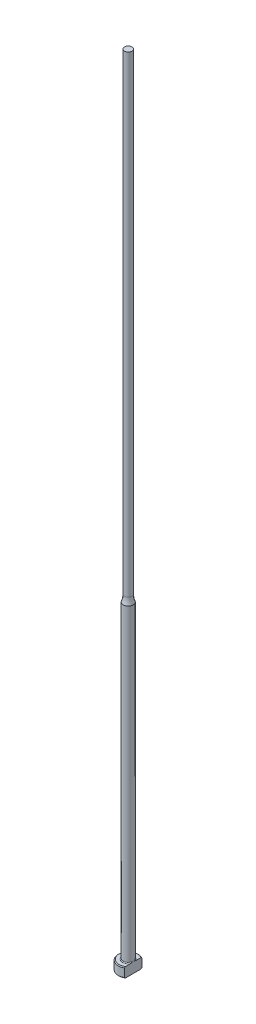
ISO-10303-21;
HEADER;
FILE_DESCRIPTION(('STEP AP214'),'2;1');
FILE_NAME('part.step','',(''),(''),'','','');
FILE_SCHEMA(('AUTOMOTIVE_DESIGN { 1 0 10303 214 1 1 1 1 }'));
ENDSEC;
DATA;
#1=APPLICATION_CONTEXT('core data for automotive mechanical design processes');
#2=APPLICATION_PROTOCOL_DEFINITION('international standard','automotive_design',2000,#1);
#3=PRODUCT_CONTEXT('',#1,'mechanical');
#4=PRODUCT('Part','Part','',(#3));
#5=PRODUCT_RELATED_PRODUCT_CATEGORY('part','',(#4));
#6=PRODUCT_DEFINITION_FORMATION('','',#4);
#7=PRODUCT_DEFINITION_CONTEXT('part definition',#1,'design');
#8=PRODUCT_DEFINITION('design','',#6,#7);
#9=PRODUCT_DEFINITION_SHAPE('','',#8);
#10=(LENGTH_UNIT() NAMED_UNIT(*) SI_UNIT(.MILLI.,.METRE.));
#11=(NAMED_UNIT(*) PLANE_ANGLE_UNIT() SI_UNIT($,.RADIAN.));
#12=(NAMED_UNIT(*) SI_UNIT($,.STERADIAN.) SOLID_ANGLE_UNIT());
#13=UNCERTAINTY_MEASURE_WITH_UNIT(LENGTH_MEASURE(1.E-05),#10,'distance_accuracy_value','');
#14=(GEOMETRIC_REPRESENTATION_CONTEXT(3) GLOBAL_UNCERTAINTY_ASSIGNED_CONTEXT((#13)) GLOBAL_UNIT_ASSIGNED_CONTEXT((#10,
#11,#12)) REPRESENTATION_CONTEXT('',''));
#15=CARTESIAN_POINT('',(0.,0.,0.));
#16=DIRECTION('',(0.,0.,1.));
#17=DIRECTION('',(1.,0.,0.));
#18=AXIS2_PLACEMENT_3D('',#15,#16,#17);
#19=CARTESIAN_POINT('',(-3.17499999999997,3.175,0.));
#20=DIRECTION('',(0.,1.,0.));
#21=DIRECTION('',(0.,0.,1.));
#22=AXIS2_PLACEMENT_3D('',#19,#20,#21);
#23=PLANE('',#22);
#24=CARTESIAN_POINT('',(0.,3.175,0.));
#25=DIRECTION('',(0.,1.,0.));
#26=DIRECTION('',(0.,0.,1.));
#27=AXIS2_PLACEMENT_3D('',#24,#25,#26);
#28=CIRCLE('',#27,2.92099999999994);
#29=CARTESIAN_POINT('',(1.58749999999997,3.175,-2.45195529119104));
#30=VERTEX_POINT('',#29);
#31=CARTESIAN_POINT('',(1.58749999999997,3.175,2.45195529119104));
#32=VERTEX_POINT('',#31);
#33=EDGE_CURVE('E105',#30,#32,#28,.T.);
#34=ORIENTED_EDGE('',*,*,#33,.T.);
#35=DIRECTION('',(0.,0.,1.));
#36=VECTOR('',#35,1.);
#37=CARTESIAN_POINT('',(1.58749999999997,3.17499999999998,2.74963065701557));
#38=LINE('',#37,#36);
#39=CARTESIAN_POINT('',(1.58749999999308,3.175,0.933255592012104));
#40=VERTEX_POINT('',#39);
#41=EDGE_CURVE('E126',#40,#32,#38,.T.);
#42=ORIENTED_EDGE('',*,*,#41,.F.);
#43=CARTESIAN_POINT('',(0.,3.175,0.));
#44=DIRECTION('',(0.,1.,0.));
#45=DIRECTION('',(0.,0.,1.));
#46=AXIS2_PLACEMENT_3D('',#43,#44,#45);
#47=CIRCLE('',#46,1.84149999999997);
#48=CARTESIAN_POINT('',(1.58749999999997,3.17500000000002,-0.933255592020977));
#49=VERTEX_POINT('',#48);
#50=EDGE_CURVE('E11',#40,#49,#47,.F.);
#51=ORIENTED_EDGE('',*,*,#50,.T.);
#52=EDGE_CURVE('E52',#30,#49,#38,.T.);
#53=ORIENTED_EDGE('',*,*,#52,.F.);
#54=EDGE_LOOP('',(#34,#42,#51,#53));
#55=FACE_BOUND('',#54,.T.);
#56=ADVANCED_FACE('F32',(#55),#23,.T.);
#57=CARTESIAN_POINT('',(0.,259.958771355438,0.));
#58=DIRECTION('',(0.,1.,0.));
#59=DIRECTION('',(0.,0.,1.));
#60=AXIS2_PLACEMENT_3D('',#57,#58,#59);
#61=CYLINDRICAL_SURFACE('',#60,3.17499999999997);
#62=CARTESIAN_POINT('',(0.,2.92100000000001,0.));
#63=DIRECTION('',(0.,1.,0.));
#64=DIRECTION('',(0.,0.,1.));
#65=AXIS2_PLACEMENT_3D('',#62,#63,#64);
#66=CIRCLE('',#65,3.17499999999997);
#67=CARTESIAN_POINT('',(1.58749999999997,2.92100000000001,2.74963065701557));
#68=VERTEX_POINT('',#67);
#69=CARTESIAN_POINT('',(1.58749999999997,2.92100000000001,-2.74963065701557));
#70=VERTEX_POINT('',#69);
#71=EDGE_CURVE('E98',#68,#70,#66,.F.);
#72=ORIENTED_EDGE('',*,*,#71,.T.);
#73=DIRECTION('',(0.,-1.,0.));
#74=VECTOR('',#73,1.);
#75=CARTESIAN_POINT('',(1.58749999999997,254.001,-2.74963065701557));
#76=LINE('',#75,#74);
#77=CARTESIAN_POINT('',(1.58749999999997,0.253999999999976,-2.74963065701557));
#78=VERTEX_POINT('',#77);
#79=EDGE_CURVE('E141',#70,#78,#76,.T.);
#80=ORIENTED_EDGE('',*,*,#79,.T.);
#81=CARTESIAN_POINT('',(0.,0.253999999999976,0.));
#82=DIRECTION('',(0.,-1.,0.));
#83=DIRECTION('',(0.,0.,-1.));
#84=AXIS2_PLACEMENT_3D('',#81,#82,#83);
#85=CIRCLE('',#84,3.17499999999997);
#86=CARTESIAN_POINT('',(1.58749999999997,0.253999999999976,2.74963065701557));
#87=VERTEX_POINT('',#86);
#88=EDGE_CURVE('E95',#78,#87,#85,.F.);
#89=ORIENTED_EDGE('',*,*,#88,.T.);
#90=DIRECTION('',(0.,-1.,0.));
#91=VECTOR('',#90,1.);
#92=CARTESIAN_POINT('',(1.58749999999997,254.001,2.74963065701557));
#93=LINE('',#92,#91);
#94=EDGE_CURVE('E88',#68,#87,#93,.T.);
#95=ORIENTED_EDGE('',*,*,#94,.F.);
#96=EDGE_LOOP('',(#72,#80,#89,#95));
#97=FACE_BOUND('',#96,.T.);
#98=ADVANCED_FACE('F191',(#97),#61,.T.);
#99=CARTESIAN_POINT('',(0.,0.,0.));
#100=DIRECTION('',(0.,-1.,0.));
#101=DIRECTION('',(0.,0.,-1.));
#102=AXIS2_PLACEMENT_3D('',#99,#100,#101);
#103=PLANE('',#102);
#104=CARTESIAN_POINT('',(0.,0.,0.));
#105=DIRECTION('',(0.,-1.,0.));
#106=DIRECTION('',(0.,0.,-1.));
#107=AXIS2_PLACEMENT_3D('',#104,#105,#106);
#108=CIRCLE('',#107,2.92100000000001);
#109=CARTESIAN_POINT('',(1.58749999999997,0.,2.45195529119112));
#110=VERTEX_POINT('',#109);
#111=CARTESIAN_POINT('',(1.58749999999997,0.,-2.45195529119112));
#112=VERTEX_POINT('',#111);
#113=EDGE_CURVE('E93',#110,#112,#108,.T.);
#114=ORIENTED_EDGE('',*,*,#113,.T.);
#115=DIRECTION('',(0.,0.,1.));
#116=VECTOR('',#115,1.);
#117=CARTESIAN_POINT('',(1.58749999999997,0.,2.74963065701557));
#118=LINE('',#117,#116);
#119=EDGE_CURVE('E78',#112,#110,#118,.T.);
#120=ORIENTED_EDGE('',*,*,#119,.T.);
#121=EDGE_LOOP('',(#114,#120));
#122=FACE_BOUND('',#121,.T.);
#123=ADVANCED_FACE('F97',(#122),#103,.T.);
#124=CARTESIAN_POINT('',(0.,3.17499999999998,0.));
#125=DIRECTION('',(0.,-1.,0.));
#126=DIRECTION('',(0.,0.,-1.));
#127=AXIS2_PLACEMENT_3D('',#124,#125,#126);
#128=CONICAL_SURFACE('',#127,2.92099999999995,0.785398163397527);
#129=ORIENTED_EDGE('',*,*,#71,.F.);
#130=CARTESIAN_POINT('',(1.58749999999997,-0.16162066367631,-6.0529050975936));
#131=CARTESIAN_POINT('',(1.58749999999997,-0.0288893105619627,-5.91567682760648));
#132=CARTESIAN_POINT('',(1.58749999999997,0.103699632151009,-5.7783103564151));
#133=CARTESIAN_POINT('',(1.58749999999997,0.368508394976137,-5.50321874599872));
#134=CARTESIAN_POINT('',(1.58749999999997,0.500728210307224,-5.36549360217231));
#135=CARTESIAN_POINT('',(1.58749999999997,0.764778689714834,-5.08953516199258));
#136=CARTESIAN_POINT('',(1.58749999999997,0.896609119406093,-4.9513016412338));
#137=CARTESIAN_POINT('',(1.58749999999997,1.15968706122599,-4.67428233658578));
#138=CARTESIAN_POINT('',(1.58749999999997,1.29093457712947,-4.53549655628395));
#139=CARTESIAN_POINT('',(1.58749999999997,1.55007705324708,-4.25997724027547));
#140=CARTESIAN_POINT('',(1.58749999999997,1.67798684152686,-4.12325766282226));
#141=CARTESIAN_POINT('',(1.58749999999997,1.9328486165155,-3.84892898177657));
#142=CARTESIAN_POINT('',(1.58749999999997,2.05980060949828,-3.71131988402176));
#143=CARTESIAN_POINT('',(1.58749999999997,2.31237508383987,-3.43493978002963));
#144=CARTESIAN_POINT('',(1.58749999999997,2.43799784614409,-3.29616903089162));
#145=CARTESIAN_POINT('',(1.58749999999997,2.68741369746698,-3.01699558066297));
#146=CARTESIAN_POINT('',(1.58749999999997,2.81120686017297,-2.8765929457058));
#147=CARTESIAN_POINT('',(1.58749999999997,3.00875865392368,-2.64816703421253));
#148=CARTESIAN_POINT('',(1.58749999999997,3.08336151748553,-2.56087478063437));
#149=CARTESIAN_POINT('',(1.58749999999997,3.2312387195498,-2.38515423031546));
#150=CARTESIAN_POINT('',(1.58749999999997,3.30451292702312,-2.29672582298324));
#151=CARTESIAN_POINT('',(1.58749999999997,3.45004422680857,-2.1174740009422));
#152=CARTESIAN_POINT('',(1.58749999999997,3.5222823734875,-2.02663514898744));
#153=CARTESIAN_POINT('',(1.58749999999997,3.66423097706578,-1.8430252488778));
#154=CARTESIAN_POINT('',(1.58749999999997,3.73394203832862,-1.75025467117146));
#155=CARTESIAN_POINT('',(1.58749999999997,3.87080633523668,-1.5606747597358));
#156=CARTESIAN_POINT('',(1.58749999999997,3.93790459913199,-1.46382547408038));
#157=CARTESIAN_POINT('',(1.58749999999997,4.06669147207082,-1.26632594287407));
#158=CARTESIAN_POINT('',(1.58749999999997,4.1283726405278,-1.16567073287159));
#159=CARTESIAN_POINT('',(1.58749999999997,4.21402252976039,-1.01165766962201));
#160=CARTESIAN_POINT('',(1.58749999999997,4.24127929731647,-0.960142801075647));
#161=CARTESIAN_POINT('',(1.58749999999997,4.2930979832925,-0.855780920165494));
#162=CARTESIAN_POINT('',(1.58749999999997,4.31765941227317,-0.802933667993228));
#163=CARTESIAN_POINT('',(1.58749999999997,4.38614656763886,-0.642461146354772));
#164=CARTESIAN_POINT('',(1.58749999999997,4.42510149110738,-0.532518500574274));
#165=CARTESIAN_POINT('',(1.58749999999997,4.46726244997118,-0.367680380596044));
#166=CARTESIAN_POINT('',(1.58749999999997,4.47844427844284,-0.314802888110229));
#167=CARTESIAN_POINT('',(1.58749999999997,4.49576654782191,-0.208209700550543));
#168=CARTESIAN_POINT('',(1.58749999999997,4.50190743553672,-0.154494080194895));
#169=CARTESIAN_POINT('',(1.58749999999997,4.50871296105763,-0.0468792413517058));
#170=CARTESIAN_POINT('',(1.58749999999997,4.5093945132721,0.00701889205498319));
#171=CARTESIAN_POINT('',(1.58749999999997,4.50527679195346,0.114606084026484));
#172=CARTESIAN_POINT('',(1.58749999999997,4.50047706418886,0.168295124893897));
#173=CARTESIAN_POINT('',(1.58749999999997,4.48579689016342,0.27448544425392));
#174=CARTESIAN_POINT('',(1.58749999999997,4.47596081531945,0.32699298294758));
#175=CARTESIAN_POINT('',(1.58749999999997,4.45181809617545,0.430974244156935));
#176=CARTESIAN_POINT('',(1.58749999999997,4.4375096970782,0.482447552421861));
#177=CARTESIAN_POINT('',(1.58749999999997,4.40502489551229,0.584460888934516));
#178=CARTESIAN_POINT('',(1.58749999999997,4.386827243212,0.634994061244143));
#179=CARTESIAN_POINT('',(1.58749999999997,4.34729308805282,0.734789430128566));
#180=CARTESIAN_POINT('',(1.58749999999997,4.3259572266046,0.784051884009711));
#181=CARTESIAN_POINT('',(1.58749999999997,4.25791922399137,0.930549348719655));
#182=CARTESIAN_POINT('',(1.58749999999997,4.20736047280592,1.0259880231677));
#183=CARTESIAN_POINT('',(1.58749999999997,4.0995545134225,1.21304313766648));
#184=CARTESIAN_POINT('',(1.58749999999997,4.04229912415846,1.30465471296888));
#185=CARTESIAN_POINT('',(1.58749999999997,3.92308746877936,1.48526211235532));
#186=CARTESIAN_POINT('',(1.58749999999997,3.86111349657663,1.57424615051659));
#187=CARTESIAN_POINT('',(1.58749999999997,3.73408621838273,1.74990003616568));
#188=CARTESIAN_POINT('',(1.58749999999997,3.66903444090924,1.83657099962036));
#189=CARTESIAN_POINT('',(1.58749999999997,3.53583371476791,2.00931764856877));
#190=CARTESIAN_POINT('',(1.58749999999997,3.46765527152,2.09537048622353));
#191=CARTESIAN_POINT('',(1.58749999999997,3.32960643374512,2.26611736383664));
#192=CARTESIAN_POINT('',(1.58749999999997,3.25973586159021,2.35081125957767));
#193=CARTESIAN_POINT('',(1.58749999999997,3.04858139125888,2.60290121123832));
#194=CARTESIAN_POINT('',(1.58749999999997,2.90542388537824,2.76872537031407));
#195=CARTESIAN_POINT('',(1.58749999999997,2.64069522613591,3.06970913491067));
#196=CARTESIAN_POINT('',(1.58749999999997,2.51959458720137,3.20528660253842));
#197=CARTESIAN_POINT('',(1.58749999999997,2.27590400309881,3.47510321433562));
#198=CARTESIAN_POINT('',(1.58749999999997,2.15331401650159,3.60934232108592));
#199=CARTESIAN_POINT('',(1.58749999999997,1.90694239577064,3.87695374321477));
#200=CARTESIAN_POINT('',(1.58749999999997,1.78315974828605,4.0103251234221));
#201=CARTESIAN_POINT('',(1.58749999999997,1.53478104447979,4.27630880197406));
#202=CARTESIAN_POINT('',(1.58749999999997,1.41018498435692,4.40892109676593));
#203=CARTESIAN_POINT('',(1.58749999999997,1.0457468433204,4.79499418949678));
#204=CARTESIAN_POINT('',(1.58749999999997,0.80507680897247,5.04767313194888));
#205=CARTESIAN_POINT('',(1.58749999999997,0.443121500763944,5.42550911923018));
#206=CARTESIAN_POINT('',(1.58749999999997,0.322378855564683,5.55118772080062));
#207=CARTESIAN_POINT('',(1.58749999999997,0.0805914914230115,5.80225207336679));
#208=CARTESIAN_POINT('',(1.58749999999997,-0.040453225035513,5.92763782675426));
#209=CARTESIAN_POINT('',(1.58749999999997,-0.161620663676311,6.0529050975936));
#210=B_SPLINE_CURVE_WITH_KNOTS('',3,(#130,#131,#132,#133,#134,#135,#136,#137,#138,#139,#140,
#141,#142,#143,#144,#145,#146,#147,#148,#149,#150,#151,#152,#153,#154,#155,#156,#157,#158,#159,
#160,#161,#162,#163,#164,#165,#166,#167,#168,#169,#170,#171,#172,#173,#174,#175,#176,#177,#178,
#179,#180,#181,#182,#183,#184,#185,#186,#187,#188,#189,#190,#191,#192,#193,#194,#195,#196,#197,
#198,#199,#200,#201,#202,#203,#204,#205,#206,#207,#208,#209),.UNSPECIFIED.,.F.,.F.,(4,2,2,2,2,2,
2,2,2,2,2,2,2,2,2,2,2,2,2,2,2,2,2,2,2,2,2,2,2,2,2,2,2,2,2,2,2,2,2,4),(0.,0.572750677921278,
1.14550874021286,1.71856057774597,2.29160869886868,2.85328006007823,3.4149477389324,
3.97649423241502,4.53801804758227,4.88249307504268,5.22700189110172,5.5751532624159,
5.92322081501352,6.27657800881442,6.63041319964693,6.80518126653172,6.9799810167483,
7.3282426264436,7.49018491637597,7.65211285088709,7.81353889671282,7.97497832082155,
8.13501929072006,8.29512313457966,8.45612518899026,8.61709438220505,8.94062993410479,
9.2645649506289,9.58978187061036,9.91483894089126,10.2441741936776,10.5735441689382,
11.2306812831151,11.7760337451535,12.3214014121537,12.8672825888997,13.4131663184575,
14.4600164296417,14.9828595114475,15.5056983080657),.UNSPECIFIED.);
#211=EDGE_CURVE('E118',#32,#68,#210,.T.);
#212=ORIENTED_EDGE('',*,*,#211,.F.);
#213=ORIENTED_EDGE('',*,*,#33,.F.);
#214=EDGE_CURVE('E117',#70,#30,#210,.T.);
#215=ORIENTED_EDGE('',*,*,#214,.F.);
#216=EDGE_LOOP('',(#129,#212,#213,#215));
#217=FACE_BOUND('',#216,.T.);
#218=ADVANCED_FACE('F162',(#217),#128,.T.);
#219=CARTESIAN_POINT('',(0.,0.253999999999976,0.));
#220=DIRECTION('',(0.,1.,0.));
#221=DIRECTION('',(0.,0.,1.));
#222=AXIS2_PLACEMENT_3D('',#219,#220,#221);
#223=CONICAL_SURFACE('',#222,3.17499999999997,0.785398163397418);
#224=ORIENTED_EDGE('',*,*,#88,.F.);
#225=CARTESIAN_POINT('',(1.58749999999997,3.33662066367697,6.0529050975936));
#226=CARTESIAN_POINT('',(1.58749999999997,3.20388931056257,5.91567682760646));
#227=CARTESIAN_POINT('',(1.58749999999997,3.07130036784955,5.77831035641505));
#228=CARTESIAN_POINT('',(1.58749999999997,2.80649160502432,5.50321874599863));
#229=CARTESIAN_POINT('',(1.58749999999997,2.67427178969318,5.3654936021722));
#230=CARTESIAN_POINT('',(1.58749999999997,2.41022131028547,5.08953516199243));
#231=CARTESIAN_POINT('',(1.58749999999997,2.27839088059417,4.95130164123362));
#232=CARTESIAN_POINT('',(1.58749999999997,2.01531293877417,4.67428233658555));
#233=CARTESIAN_POINT('',(1.58749999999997,1.88406542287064,4.5354965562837));
#234=CARTESIAN_POINT('',(1.58749999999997,1.62492294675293,4.25997724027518));
#235=CARTESIAN_POINT('',(1.58749999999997,1.49701315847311,4.12325766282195));
#236=CARTESIAN_POINT('',(1.58749999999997,1.24215138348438,3.84892898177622));
#237=CARTESIAN_POINT('',(1.58749999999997,1.11519939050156,3.71131988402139));
#238=CARTESIAN_POINT('',(1.58749999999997,0.862624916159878,3.43493978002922));
#239=CARTESIAN_POINT('',(1.58749999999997,0.737002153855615,3.29616903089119));
#240=CARTESIAN_POINT('',(1.58749999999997,0.487586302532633,3.01699558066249));
#241=CARTESIAN_POINT('',(1.58749999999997,0.363793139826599,2.8765929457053));
#242=CARTESIAN_POINT('',(1.58749999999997,0.166241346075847,2.64816703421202));
#243=CARTESIAN_POINT('',(1.58749999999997,0.0916384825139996,2.56087478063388));
#244=CARTESIAN_POINT('',(1.58749999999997,-0.0562387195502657,2.385154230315));
#245=CARTESIAN_POINT('',(1.58749999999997,-0.129512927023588,2.29672582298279));
#246=CARTESIAN_POINT('',(1.58749999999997,-0.27504422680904,2.11747400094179));
#247=CARTESIAN_POINT('',(1.58749999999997,-0.347282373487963,2.02663514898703));
#248=CARTESIAN_POINT('',(1.58749999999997,-0.489230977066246,1.84302524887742));
#249=CARTESIAN_POINT('',(1.58749999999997,-0.558942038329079,1.7502546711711));
#250=CARTESIAN_POINT('',(1.58749999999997,-0.695806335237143,1.56067475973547));
#251=CARTESIAN_POINT('',(1.58749999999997,-0.762904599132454,1.46382547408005));
#252=CARTESIAN_POINT('',(1.58749999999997,-0.891691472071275,1.26632594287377));
#253=CARTESIAN_POINT('',(1.58749999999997,-0.953372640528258,1.16567073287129));
#254=CARTESIAN_POINT('',(1.58749999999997,-1.03902252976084,1.01165766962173));
#255=CARTESIAN_POINT('',(1.58749999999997,-1.06627929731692,0.960142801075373));
#256=CARTESIAN_POINT('',(1.58749999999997,-1.11809798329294,0.85578092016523));
#257=CARTESIAN_POINT('',(1.58749999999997,-1.14265941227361,0.802933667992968));
#258=CARTESIAN_POINT('',(1.58749999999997,-1.21114656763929,0.642461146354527));
#259=CARTESIAN_POINT('',(1.58749999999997,-1.2501014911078,0.532518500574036));
#260=CARTESIAN_POINT('',(1.58749999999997,-1.29226244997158,0.367680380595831));
#261=CARTESIAN_POINT('',(1.58749999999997,-1.30344427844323,0.314802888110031));
#262=CARTESIAN_POINT('',(1.58749999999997,-1.32076654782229,0.208209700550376));
#263=CARTESIAN_POINT('',(1.58749999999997,-1.3269074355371,0.154494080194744));
#264=CARTESIAN_POINT('',(1.58749999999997,-1.333712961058,0.0468792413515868));
#265=CARTESIAN_POINT('',(1.58749999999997,-1.33439451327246,-0.00701889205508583));
#266=CARTESIAN_POINT('',(1.58749999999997,-1.33027679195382,-0.114606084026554));
#267=CARTESIAN_POINT('',(1.58749999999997,-1.32547706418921,-0.168295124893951));
#268=CARTESIAN_POINT('',(1.58749999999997,-1.31079689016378,-0.274485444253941));
#269=CARTESIAN_POINT('',(1.58749999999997,-1.3009608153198,-0.326992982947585));
#270=CARTESIAN_POINT('',(1.58749999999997,-1.27681809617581,-0.430974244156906));
#271=CARTESIAN_POINT('',(1.58749999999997,-1.26250969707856,-0.482447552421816));
#272=CARTESIAN_POINT('',(1.58749999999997,-1.23002489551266,-0.584460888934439));
#273=CARTESIAN_POINT('',(1.58749999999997,-1.21182724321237,-0.634994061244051));
#274=CARTESIAN_POINT('',(1.58749999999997,-1.1722930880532,-0.734789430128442));
#275=CARTESIAN_POINT('',(1.58749999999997,-1.15095722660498,-0.784051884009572));
#276=CARTESIAN_POINT('',(1.58749999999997,-1.08291922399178,-0.93054934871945));
#277=CARTESIAN_POINT('',(1.58749999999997,-1.03236047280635,-1.02598802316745));
#278=CARTESIAN_POINT('',(1.58749999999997,-0.924554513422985,-1.21304313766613));
#279=CARTESIAN_POINT('',(1.58749999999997,-0.86729912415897,-1.30465471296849));
#280=CARTESIAN_POINT('',(1.58749999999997,-0.748087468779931,-1.48526211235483));
#281=CARTESIAN_POINT('',(1.58749999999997,-0.686113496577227,-1.57424615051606));
#282=CARTESIAN_POINT('',(1.58749999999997,-0.55908621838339,-1.74990003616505));
#283=CARTESIAN_POINT('',(1.58749999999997,-0.494034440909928,-1.83657099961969));
#284=CARTESIAN_POINT('',(1.58749999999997,-0.360833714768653,-2.00931764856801));
#285=CARTESIAN_POINT('',(1.58749999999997,-0.292655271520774,-2.09537048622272));
#286=CARTESIAN_POINT('',(1.58749999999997,-0.154606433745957,-2.26611736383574));
#287=CARTESIAN_POINT('',(1.58749999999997,-0.0847358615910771,-2.35081125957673));
#288=CARTESIAN_POINT('',(1.58749999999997,0.126418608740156,-2.60290121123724));
#289=CARTESIAN_POINT('',(1.58749999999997,0.269576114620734,-2.76872537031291));
#290=CARTESIAN_POINT('',(1.58749999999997,0.534304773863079,-3.06970913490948));
#291=CARTESIAN_POINT('',(1.58749999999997,0.655405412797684,-3.20528660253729));
#292=CARTESIAN_POINT('',(1.58749999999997,0.899095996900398,-3.47510321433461));
#293=CARTESIAN_POINT('',(1.58749999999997,1.02168598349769,-3.60934232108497));
#294=CARTESIAN_POINT('',(1.58749999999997,1.26805760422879,-3.87695374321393));
#295=CARTESIAN_POINT('',(1.58749999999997,1.39184025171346,-4.01032512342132));
#296=CARTESIAN_POINT('',(1.58749999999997,1.64021895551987,-4.2763088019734));
#297=CARTESIAN_POINT('',(1.58749999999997,1.76481501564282,-4.40892109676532));
#298=CARTESIAN_POINT('',(1.58749999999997,2.12925315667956,-4.79499418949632));
#299=CARTESIAN_POINT('',(1.58749999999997,2.36992319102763,-5.04767313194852));
#300=CARTESIAN_POINT('',(1.58749999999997,2.73187849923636,-5.42550911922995));
#301=CARTESIAN_POINT('',(1.58749999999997,2.85262114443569,-5.55118772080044));
#302=CARTESIAN_POINT('',(1.58749999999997,3.09440850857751,-5.8022520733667));
#303=CARTESIAN_POINT('',(1.58749999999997,3.2154532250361,-5.92763782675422));
#304=CARTESIAN_POINT('',(1.58749999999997,3.33662066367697,-6.0529050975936));
#305=B_SPLINE_CURVE_WITH_KNOTS('',3,(#225,#226,#227,#228,#229,#230,#231,#232,#233,#234,#235,
#236,#237,#238,#239,#240,#241,#242,#243,#244,#245,#246,#247,#248,#249,#250,#251,#252,#253,#254,
#255,#256,#257,#258,#259,#260,#261,#262,#263,#264,#265,#266,#267,#268,#269,#270,#271,#272,#273,
#274,#275,#276,#277,#278,#279,#280,#281,#282,#283,#284,#285,#286,#287,#288,#289,#290,#291,#292,
#293,#294,#295,#296,#297,#298,#299,#300,#301,#302,#303,#304),.UNSPECIFIED.,.F.,.F.,(4,2,2,2,2,2,
2,2,2,2,2,2,2,2,2,2,2,2,2,2,2,2,2,2,2,2,2,2,2,2,2,2,2,2,2,2,2,2,2,4),(0.,0.57275067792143,
1.14550874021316,1.71856057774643,2.29160869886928,2.85328006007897,3.41494773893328,
3.97649423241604,4.53801804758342,4.88249307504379,5.2270018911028,5.57515326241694,
5.92322081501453,6.27657800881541,6.63041319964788,6.80518126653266,6.97998101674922,
7.32824262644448,7.49018491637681,7.65211285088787,7.81353889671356,7.97497832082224,
8.1350192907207,8.29512313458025,8.45612518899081,8.61709438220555,8.94062993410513,
9.26456495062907,9.58978187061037,9.91483894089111,10.2441741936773,10.5735441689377,
11.2306812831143,11.776033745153,12.3214014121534,12.8672825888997,13.4131663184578,
14.4600164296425,14.9828595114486,15.505698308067),.UNSPECIFIED.);
#306=EDGE_CURVE('E81',#112,#78,#305,.T.);
#307=ORIENTED_EDGE('',*,*,#306,.F.);
#308=ORIENTED_EDGE('',*,*,#113,.F.);
#309=EDGE_CURVE('E84',#87,#110,#305,.T.);
#310=ORIENTED_EDGE('',*,*,#309,.F.);
#311=EDGE_LOOP('',(#224,#307,#308,#310));
#312=FACE_BOUND('',#311,.T.);
#313=ADVANCED_FACE('F92',(#312),#223,.T.);
#314=CARTESIAN_POINT('',(0.,3.42900000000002,0.));
#315=DIRECTION('',(0.,1.,0.));
#316=DIRECTION('',(0.,0.,1.));
#317=AXIS2_PLACEMENT_3D('',#314,#315,#316);
#318=TOROIDAL_SURFACE('',#317,1.84149999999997,0.254);
#319=CARTESIAN_POINT('',(1.58749999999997,3.42900000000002,0.));
#320=CARTESIAN_POINT('',(1.58749999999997,3.42899942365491,-1.9220514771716E-10));
#321=CARTESIAN_POINT('',(1.58749999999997,3.42899884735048,-1.2261161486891E-07));
#322=CARTESIAN_POINT('',(1.58749999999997,3.42899773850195,-5.09676365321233E-07));
#323=CARTESIAN_POINT('',(1.58749999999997,3.42899720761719,-7.78176328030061E-07));
#324=CARTESIAN_POINT('',(1.58749999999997,3.42899614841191,-1.42307272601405E-06));
#325=CARTESIAN_POINT('',(1.58749999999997,3.42899562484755,-1.80713867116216E-06));
#326=CARTESIAN_POINT('',(1.58749999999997,3.42899463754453,-2.63494846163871E-06));
#327=CARTESIAN_POINT('',(1.58749999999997,3.42899417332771,-3.07814756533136E-06));
#328=CARTESIAN_POINT('',(1.58749999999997,3.42899261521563,-4.66897357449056E-06));
#329=CARTESIAN_POINT('',(1.58749999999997,3.42899159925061,-5.89404908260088E-06));
#330=CARTESIAN_POINT('',(1.58749999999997,3.42898979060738,-8.42427511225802E-06));
#331=CARTESIAN_POINT('',(1.58749999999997,3.42898899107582,-9.7248057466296E-06));
#332=CARTESIAN_POINT('',(1.58749999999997,3.42898598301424,-1.48060601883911E-05));
#333=CARTESIAN_POINT('',(1.58749999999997,3.42898393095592,-1.86838281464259E-05));
#334=CARTESIAN_POINT('',(1.58749999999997,3.42898057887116,-2.63261117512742E-05));
#335=CARTESIAN_POINT('',(1.58749999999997,3.42897922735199,-3.00687417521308E-05));
#336=CARTESIAN_POINT('',(1.58749999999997,3.42897347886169,-4.60276298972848E-05));
#337=CARTESIAN_POINT('',(1.58749999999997,3.42896911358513,-5.8247019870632E-05));
#338=CARTESIAN_POINT('',(1.58749999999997,3.42896211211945,-8.11070097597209E-05));
#339=CARTESIAN_POINT('',(1.58749999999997,3.42895931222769,-9.16953114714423E-05));
#340=CARTESIAN_POINT('',(1.58749999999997,3.42893712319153,-0.000168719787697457));
#341=CARTESIAN_POINT('',(1.58749999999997,3.42890881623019,-0.000232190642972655));
#342=CARTESIAN_POINT('',(1.58749999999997,3.42880276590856,-0.000479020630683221));
#343=CARTESIAN_POINT('',(1.58749999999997,3.42873165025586,-0.00066443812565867));
#344=CARTESIAN_POINT('',(1.58749999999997,3.42845137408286,-0.0013844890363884));
#345=CARTESIAN_POINT('',(1.58749999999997,3.42823526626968,-0.00191701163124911));
#346=CARTESIAN_POINT('',(1.58749999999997,3.42735449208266,-0.00409774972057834));
#347=CARTESIAN_POINT('',(1.58749999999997,3.42669768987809,-0.00574830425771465));
#348=CARTESIAN_POINT('',(1.58749999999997,3.4174405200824,-0.0289985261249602));
#349=CARTESIAN_POINT('',(1.58749999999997,3.40878325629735,-0.0505816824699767));
#350=CARTESIAN_POINT('',(1.58749999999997,3.39189297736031,-0.0929947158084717));
#351=CARTESIAN_POINT('',(1.58749999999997,3.38365605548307,-0.11382315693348));
#352=CARTESIAN_POINT('',(1.58749999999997,3.36635393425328,-0.157956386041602));
#353=CARTESIAN_POINT('',(1.58749999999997,3.35730391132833,-0.181267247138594));
#354=CARTESIAN_POINT('',(1.58749999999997,3.33936775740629,-0.228222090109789));
#355=CARTESIAN_POINT('',(1.58749999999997,3.33048420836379,-0.25186705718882));
#356=CARTESIAN_POINT('',(1.58749999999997,3.30894496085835,-0.310512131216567));
#357=CARTESIAN_POINT('',(1.58749999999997,3.29649449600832,-0.345588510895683));
#358=CARTESIAN_POINT('',(1.58749999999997,3.27296975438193,-0.415278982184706));
#359=CARTESIAN_POINT('',(1.58749999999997,3.26186987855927,-0.449884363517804));
#360=CARTESIAN_POINT('',(1.58749999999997,3.2395832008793,-0.524471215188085));
#361=CARTESIAN_POINT('',(1.58749999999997,3.22860862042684,-0.564517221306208));
#362=CARTESIAN_POINT('',(1.58749999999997,3.20902534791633,-0.645529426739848));
#363=CARTESIAN_POINT('',(1.58749999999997,3.20043582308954,-0.686500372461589));
#364=CARTESIAN_POINT('',(1.58749999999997,3.18611712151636,-0.771546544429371));
#365=CARTESIAN_POINT('',(1.58749999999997,3.18059550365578,-0.815658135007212));
#366=CARTESIAN_POINT('',(1.58749999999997,3.17455396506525,-0.904117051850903));
#367=CARTESIAN_POINT('',(1.58749999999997,3.17401361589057,-0.948462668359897));
#368=CARTESIAN_POINT('',(1.58749999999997,3.17898948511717,-1.02531896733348));
#369=CARTESIAN_POINT('',(1.58749999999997,3.1829739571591,-1.05792141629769));
#370=CARTESIAN_POINT('',(1.58749999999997,3.19569167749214,-1.12184393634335));
#371=CARTESIAN_POINT('',(1.58749999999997,3.20436049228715,-1.1531753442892));
#372=CARTESIAN_POINT('',(1.58749999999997,3.22236152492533,-1.19946468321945));
#373=CARTESIAN_POINT('',(1.58749999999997,3.2295150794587,-1.21526783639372));
#374=CARTESIAN_POINT('',(1.58749999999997,3.24587062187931,-1.24583726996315));
#375=CARTESIAN_POINT('',(1.58749999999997,3.25507530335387,-1.26060215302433));
#376=CARTESIAN_POINT('',(1.58749999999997,3.27378481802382,-1.28575815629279));
#377=CARTESIAN_POINT('',(1.58749999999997,3.28289001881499,-1.29644383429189));
#378=CARTESIAN_POINT('',(1.58749999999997,3.30268460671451,-1.31623154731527));
#379=CARTESIAN_POINT('',(1.58749999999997,3.31337067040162,-1.32533681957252));
#380=CARTESIAN_POINT('',(1.58749999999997,3.33349977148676,-1.33941140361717));
#381=CARTESIAN_POINT('',(1.58749999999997,3.34261446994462,-1.34484814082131));
#382=CARTESIAN_POINT('',(1.58749999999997,3.36161455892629,-1.35416329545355));
#383=CARTESIAN_POINT('',(1.58749999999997,3.37149946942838,-1.35804267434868));
#384=CARTESIAN_POINT('',(1.58749999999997,3.39188678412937,-1.36398436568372));
#385=CARTESIAN_POINT('',(1.58749999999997,3.40239309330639,-1.36603350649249));
#386=CARTESIAN_POINT('',(1.58749999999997,3.42360372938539,-1.3680840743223));
#387=CARTESIAN_POINT('',(1.58749999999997,3.43430795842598,-1.36808648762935));
#388=CARTESIAN_POINT('',(1.58749999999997,3.45433283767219,-1.36616208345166));
#389=CARTESIAN_POINT('',(1.58749999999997,3.46367506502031,-1.36444960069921));
#390=CARTESIAN_POINT('',(1.58749999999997,3.48195519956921,-1.35953338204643));
#391=CARTESIAN_POINT('',(1.58749999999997,3.49089304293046,-1.3563294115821));
#392=CARTESIAN_POINT('',(1.58749999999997,3.50850302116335,-1.34848006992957));
#393=CARTESIAN_POINT('',(1.58749999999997,3.5171531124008,-1.34378578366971));
#394=CARTESIAN_POINT('',(1.58749999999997,3.53371257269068,-1.33324445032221));
#395=CARTESIAN_POINT('',(1.58749999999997,3.54162163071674,-1.32739692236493));
#396=CARTESIAN_POINT('',(1.58749999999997,3.56107121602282,-1.31107304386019));
#397=CARTESIAN_POINT('',(1.58749999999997,3.57202221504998,-1.29989286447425));
#398=CARTESIAN_POINT('',(1.58749999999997,3.59202509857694,-1.27593566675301));
#399=CARTESIAN_POINT('',(1.58749999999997,3.60107086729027,-1.26315370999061));
#400=CARTESIAN_POINT('',(1.58749999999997,3.62186023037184,-1.22930733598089));
#401=CARTESIAN_POINT('',(1.58749999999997,3.63240584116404,-1.20751096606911));
#402=CARTESIAN_POINT('',(1.58749999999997,3.65004643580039,-1.16266144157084));
#403=CARTESIAN_POINT('',(1.58749999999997,3.65714435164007,-1.13960937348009));
#404=CARTESIAN_POINT('',(1.58749999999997,3.67265428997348,-1.07603916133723));
#405=CARTESIAN_POINT('',(1.58749999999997,3.67834921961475,-1.03486686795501));
#406=CARTESIAN_POINT('',(1.58749999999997,3.68382880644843,-0.951558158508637));
#407=CARTESIAN_POINT('',(1.58749999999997,3.68350976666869,-0.909417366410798));
#408=CARTESIAN_POINT('',(1.58749999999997,3.67745397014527,-0.811383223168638));
#409=CARTESIAN_POINT('',(1.58749999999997,3.66993873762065,-0.755610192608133));
#410=CARTESIAN_POINT('',(1.58749999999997,3.64933373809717,-0.644937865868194));
#411=CARTESIAN_POINT('',(1.58749999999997,3.63621897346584,-0.59004364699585));
#412=CARTESIAN_POINT('',(1.58749999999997,3.60740922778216,-0.485757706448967));
#413=CARTESIAN_POINT('',(1.58749999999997,3.59201096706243,-0.436281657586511));
#414=CARTESIAN_POINT('',(1.58749999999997,3.55922497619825,-0.338551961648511));
#415=CARTESIAN_POINT('',(1.58749999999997,3.5418584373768,-0.290291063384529));
#416=CARTESIAN_POINT('',(1.58749999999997,3.51760237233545,-0.225557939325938));
#417=CARTESIAN_POINT('',(1.58749999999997,3.51126413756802,-0.208874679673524));
#418=CARTESIAN_POINT('',(1.58749999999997,3.49830042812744,-0.17512392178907));
#419=CARTESIAN_POINT('',(1.58749999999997,3.49167176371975,-0.158057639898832));
#420=CARTESIAN_POINT('',(1.58749999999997,3.47585523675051,-0.117638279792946));
#421=CARTESIAN_POINT('',(1.58749999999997,3.46662970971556,-0.0943002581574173));
#422=CARTESIAN_POINT('',(1.58749999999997,3.44889695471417,-0.0497824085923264));
#423=CARTESIAN_POINT('',(1.58749999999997,3.44040039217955,-0.028598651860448));
#424=CARTESIAN_POINT('',(1.58749999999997,3.43130364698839,-0.00575168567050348));
#425=CARTESIAN_POINT('',(1.58749999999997,3.43064818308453,-0.00410451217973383));
#426=CARTESIAN_POINT('',(1.58749999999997,3.42976776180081,-0.00192459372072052));
#427=CARTESIAN_POINT('',(1.58749999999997,3.42955062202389,-0.00138952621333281));
#428=CARTESIAN_POINT('',(1.58749999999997,3.42926908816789,-0.000666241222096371));
#429=CARTESIAN_POINT('',(1.58749999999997,3.42919771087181,-0.000480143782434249));
#430=CARTESIAN_POINT('',(1.58749999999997,3.42909131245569,-0.000232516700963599));
#431=CARTESIAN_POINT('',(1.58749999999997,3.42906294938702,-0.000168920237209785));
#432=CARTESIAN_POINT('',(1.58749999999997,3.42904072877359,-9.17527162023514E-05));
#433=CARTESIAN_POINT('',(1.58749999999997,3.42903792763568,-8.11550293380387E-05));
#434=CARTESIAN_POINT('',(1.58749999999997,3.42903091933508,-5.82743948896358E-05));
#435=CARTESIAN_POINT('',(1.58749999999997,3.42902654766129,-4.60440001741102E-05));
#436=CARTESIAN_POINT('',(1.58749999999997,3.42902079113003,-3.00727682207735E-05));
#437=CARTESIAN_POINT('',(1.58749999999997,3.42901943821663,-2.63286807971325E-05));
#438=CARTESIAN_POINT('',(1.58749999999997,3.42901608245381,-1.86836529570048E-05));
#439=CARTESIAN_POINT('',(1.58749999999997,3.4290140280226,-1.48046517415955E-05));
#440=CARTESIAN_POINT('',(1.58749999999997,3.42901101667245,-9.72223943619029E-06));
#441=CARTESIAN_POINT('',(1.58749999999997,3.42901021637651,-8.42159649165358E-06));
#442=CARTESIAN_POINT('',(1.58749999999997,3.42900840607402,-5.89129729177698E-06));
#443=CARTESIAN_POINT('',(1.58749999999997,3.42900738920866,-4.66626867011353E-06));
#444=CARTESIAN_POINT('',(1.58749999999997,3.42900582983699,-3.07568803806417E-06));
#445=CARTESIAN_POINT('',(1.58749999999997,3.42900536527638,-2.63259565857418E-06));
#446=CARTESIAN_POINT('',(1.58749999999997,3.4290043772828,-1.80506085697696E-06));
#447=CARTESIAN_POINT('',(1.58749999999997,3.42900385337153,-1.42116387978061E-06));
#448=CARTESIAN_POINT('',(1.58749999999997,3.42900279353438,-7.76675643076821E-07));
#449=CARTESIAN_POINT('',(1.58749999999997,3.42900226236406,-5.08406487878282E-07));
#450=CARTESIAN_POINT('',(1.58749999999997,3.42900115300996,-1.21901887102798E-07));
#451=CARTESIAN_POINT('',(1.58749999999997,3.42900057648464,1.92251677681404E-10));
#452=CARTESIAN_POINT('',(1.58749999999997,3.42900000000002,0.));
#453=B_SPLINE_CURVE_WITH_KNOTS('',3,(#319,#320,#321,#322,#323,#324,#325,#326,#327,#328,#329,
#330,#331,#332,#333,#334,#335,#336,#337,#338,#339,#340,#341,#342,#343,#344,#345,#346,#347,#348,
#349,#350,#351,#352,#353,#354,#355,#356,#357,#358,#359,#360,#361,#362,#363,#364,#365,#366,#367,
#368,#369,#370,#371,#372,#373,#374,#375,#376,#377,#378,#379,#380,#381,#382,#383,#384,#385,#386,
#387,#388,#389,#390,#391,#392,#393,#394,#395,#396,#397,#398,#399,#400,#401,#402,#403,#404,#405,
#406,#407,#408,#409,#410,#411,#412,#413,#414,#415,#416,#417,#418,#419,#420,#421,#422,#423,#424,
#425,#426,#427,#428,#429,#430,#431,#432,#433,#434,#435,#436,#437,#438,#439,#440,#441,#442,#443,
#444,#445,#446,#447,#448,#449,#450,#451,#452),.UNSPECIFIED.,.T.,.F.,(4,2,2,2,2,2,2,2,2,2,2,2,2,
2,2,2,2,2,2,2,2,2,2,2,2,2,2,2,2,2,2,2,2,2,2,2,2,2,2,2,2,2,2,2,2,2,2,2,2,2,2,2,2,2,2,2,2,2,2,2,2,
2,2,2,2,2,4),(0.,1.72815458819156E-06,3.50429255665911E-06,5.44431004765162E-06,
7.3675525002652E-06,1.2119089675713E-05,1.66953775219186E-05,2.98160400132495E-05,
4.17409564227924E-05,8.0660475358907E-05,0.000113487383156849,0.000321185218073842,
0.000917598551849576,0.00264089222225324,0.00797105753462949,0.0777276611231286,
0.144923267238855,0.219939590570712,0.295714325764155,0.407362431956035,0.516367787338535,
0.640878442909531,0.766362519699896,0.899536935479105,1.03216495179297,1.13045740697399,
1.22743103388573,1.27935899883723,1.33135556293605,1.37333248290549,1.41522237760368,
1.44693946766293,1.47863694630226,1.51056074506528,1.54246916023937,1.57083210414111,
1.59919951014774,1.62861579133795,1.65804436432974,1.70472658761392,1.75155645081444,
1.82378709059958,1.89595619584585,2.01995471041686,2.1460932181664,2.31447224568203,
2.48361094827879,2.6389891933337,2.79283011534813,2.84637031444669,2.9012946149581,
2.97658236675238,3.04504771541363,3.05036697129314,3.05209849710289,3.05269709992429,
3.05290520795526,3.05293806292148,3.05297701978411,3.05298895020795,3.05300207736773,
3.05300665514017,3.0530114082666,3.05301333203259,3.05301527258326,3.05301704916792,
3.05301877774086),.UNSPECIFIED.);
#454=CARTESIAN_POINT('',(1.58749999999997,3.42900000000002,0.));
#455=VERTEX_POINT('',#454);
#456=EDGE_CURVE('E47',#455,#49,#453,.T.);
#457=ORIENTED_EDGE('',*,*,#456,.T.);
#458=ORIENTED_EDGE('',*,*,#50,.F.);
#459=CARTESIAN_POINT('',(1.58749999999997,3.42900000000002,0.));
#460=CARTESIAN_POINT('',(1.58749999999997,3.42900057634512,1.9220512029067E-10));
#461=CARTESIAN_POINT('',(1.58749999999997,3.42900115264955,1.22611614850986E-07));
#462=CARTESIAN_POINT('',(1.58749999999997,3.42900226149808,5.09676365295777E-07));
#463=CARTESIAN_POINT('',(1.58749999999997,3.42900279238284,7.78176328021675E-07));
#464=CARTESIAN_POINT('',(1.58749999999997,3.42900385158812,1.42307272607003E-06));
#465=CARTESIAN_POINT('',(1.58749999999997,3.42900437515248,1.80713867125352E-06));
#466=CARTESIAN_POINT('',(1.58749999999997,3.4290053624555,2.63494846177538E-06));
#467=CARTESIAN_POINT('',(1.58749999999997,3.42900582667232,3.0781475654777E-06));
#468=CARTESIAN_POINT('',(1.58749999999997,3.4290073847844,4.66897357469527E-06));
#469=CARTESIAN_POINT('',(1.58749999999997,3.42900840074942,5.89404908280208E-06));
#470=CARTESIAN_POINT('',(1.58749999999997,3.42901020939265,8.42427511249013E-06));
#471=CARTESIAN_POINT('',(1.58749999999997,3.42901100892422,9.72480574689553E-06));
#472=CARTESIAN_POINT('',(1.58749999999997,3.42901401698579,1.48060601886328E-05));
#473=CARTESIAN_POINT('',(1.58749999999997,3.42901606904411,1.86838281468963E-05));
#474=CARTESIAN_POINT('',(1.58749999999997,3.42901942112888,2.63261117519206E-05));
#475=CARTESIAN_POINT('',(1.58749999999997,3.42902077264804,3.00687417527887E-05));
#476=CARTESIAN_POINT('',(1.58749999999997,3.42902652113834,4.60276298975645E-05));
#477=CARTESIAN_POINT('',(1.58749999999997,3.4290308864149,5.82470198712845E-05));
#478=CARTESIAN_POINT('',(1.58749999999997,3.42903788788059,8.11070097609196E-05));
#479=CARTESIAN_POINT('',(1.58749999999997,3.42904068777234,9.16953114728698E-05));
#480=CARTESIAN_POINT('',(1.58749999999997,3.4290628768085,0.000168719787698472));
#481=CARTESIAN_POINT('',(1.58749999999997,3.42909118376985,0.000232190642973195));
#482=CARTESIAN_POINT('',(1.58749999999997,3.42919723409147,0.000479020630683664));
#483=CARTESIAN_POINT('',(1.58749999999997,3.42926834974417,0.000664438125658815));
#484=CARTESIAN_POINT('',(1.58749999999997,3.42954862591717,0.00138448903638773));
#485=CARTESIAN_POINT('',(1.58749999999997,3.42976473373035,0.00191701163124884));
#486=CARTESIAN_POINT('',(1.58749999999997,3.43064550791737,0.00409774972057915));
#487=CARTESIAN_POINT('',(1.58749999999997,3.43130231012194,0.00574830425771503));
#488=CARTESIAN_POINT('',(1.58749999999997,3.44055947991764,0.0289985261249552));
#489=CARTESIAN_POINT('',(1.58749999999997,3.44921674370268,0.0505816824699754));
#490=CARTESIAN_POINT('',(1.58749999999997,3.46610702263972,0.0929947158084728));
#491=CARTESIAN_POINT('',(1.58749999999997,3.47434394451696,0.11382315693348));
#492=CARTESIAN_POINT('',(1.58749999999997,3.49164606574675,0.157956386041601));
#493=CARTESIAN_POINT('',(1.58749999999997,3.5006960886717,0.181267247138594));
#494=CARTESIAN_POINT('',(1.58749999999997,3.51863224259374,0.228222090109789));
#495=CARTESIAN_POINT('',(1.58749999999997,3.52751579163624,0.25186705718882));
#496=CARTESIAN_POINT('',(1.58749999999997,3.54905503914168,0.310512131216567));
#497=CARTESIAN_POINT('',(1.58749999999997,3.56150550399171,0.345588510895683));
#498=CARTESIAN_POINT('',(1.58749999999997,3.5850302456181,0.415278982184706));
#499=CARTESIAN_POINT('',(1.58749999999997,3.59613012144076,0.449884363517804));
#500=CARTESIAN_POINT('',(1.58749999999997,3.61841679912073,0.524471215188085));
#501=CARTESIAN_POINT('',(1.58749999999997,3.62939137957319,0.564517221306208));
#502=CARTESIAN_POINT('',(1.58749999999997,3.6489746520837,0.645529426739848));
#503=CARTESIAN_POINT('',(1.58749999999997,3.65756417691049,0.686500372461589));
#504=CARTESIAN_POINT('',(1.58749999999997,3.67188287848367,0.771546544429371));
#505=CARTESIAN_POINT('',(1.58749999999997,3.67740449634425,0.815658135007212));
#506=CARTESIAN_POINT('',(1.58749999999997,3.68344603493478,0.904117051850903));
#507=CARTESIAN_POINT('',(1.58749999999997,3.68398638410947,0.948462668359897));
#508=CARTESIAN_POINT('',(1.58749999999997,3.67901051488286,1.02531896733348));
#509=CARTESIAN_POINT('',(1.58749999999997,3.67502604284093,1.05792141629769));
#510=CARTESIAN_POINT('',(1.58749999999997,3.66230832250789,1.12184393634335));
#511=CARTESIAN_POINT('',(1.58749999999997,3.65363950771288,1.1531753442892));
#512=CARTESIAN_POINT('',(1.58749999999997,3.6356384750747,1.19946468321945));
#513=CARTESIAN_POINT('',(1.58749999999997,3.62848492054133,1.21526783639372));
#514=CARTESIAN_POINT('',(1.58749999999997,3.61212937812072,1.24583726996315));
#515=CARTESIAN_POINT('',(1.58749999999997,3.60292469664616,1.26060215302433));
#516=CARTESIAN_POINT('',(1.58749999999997,3.58421518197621,1.28575815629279));
#517=CARTESIAN_POINT('',(1.58749999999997,3.57510998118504,1.29644383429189));
#518=CARTESIAN_POINT('',(1.58749999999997,3.55531539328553,1.31623154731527));
#519=CARTESIAN_POINT('',(1.58749999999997,3.54462932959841,1.32533681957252));
#520=CARTESIAN_POINT('',(1.58749999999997,3.52450022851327,1.33941140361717));
#521=CARTESIAN_POINT('',(1.58749999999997,3.51538553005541,1.34484814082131));
#522=CARTESIAN_POINT('',(1.58749999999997,3.49638544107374,1.35416329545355));
#523=CARTESIAN_POINT('',(1.58749999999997,3.48650053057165,1.35804267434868));
#524=CARTESIAN_POINT('',(1.58749999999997,3.46611321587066,1.36398436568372));
#525=CARTESIAN_POINT('',(1.58749999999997,3.45560690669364,1.36603350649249));
#526=CARTESIAN_POINT('',(1.58749999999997,3.43439627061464,1.3680840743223));
#527=CARTESIAN_POINT('',(1.58749999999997,3.42369204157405,1.36808648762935));
#528=CARTESIAN_POINT('',(1.58749999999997,3.40366716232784,1.36616208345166));
#529=CARTESIAN_POINT('',(1.58749999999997,3.39432493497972,1.36444960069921));
#530=CARTESIAN_POINT('',(1.58749999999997,3.37604480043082,1.35953338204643));
#531=CARTESIAN_POINT('',(1.58749999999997,3.36710695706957,1.3563294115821));
#532=CARTESIAN_POINT('',(1.58749999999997,3.34949697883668,1.34848006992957));
#533=CARTESIAN_POINT('',(1.58749999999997,3.34084688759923,1.34378578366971));
#534=CARTESIAN_POINT('',(1.58749999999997,3.32428742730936,1.33324445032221));
#535=CARTESIAN_POINT('',(1.58749999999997,3.31637836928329,1.32739692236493));
#536=CARTESIAN_POINT('',(1.58749999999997,3.29692878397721,1.31107304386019));
#537=CARTESIAN_POINT('',(1.58749999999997,3.28597778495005,1.29989286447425));
#538=CARTESIAN_POINT('',(1.58749999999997,3.26597490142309,1.27593566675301));
#539=CARTESIAN_POINT('',(1.58749999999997,3.25692913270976,1.26315370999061));
#540=CARTESIAN_POINT('',(1.58749999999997,3.23613976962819,1.22930733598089));
#541=CARTESIAN_POINT('',(1.58749999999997,3.22559415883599,1.20751096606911));
#542=CARTESIAN_POINT('',(1.58749999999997,3.20795356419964,1.16266144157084));
#543=CARTESIAN_POINT('',(1.58749999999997,3.20085564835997,1.13960937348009));
#544=CARTESIAN_POINT('',(1.58749999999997,3.18534571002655,1.07603916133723));
#545=CARTESIAN_POINT('',(1.58749999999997,3.17965078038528,1.03486686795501));
#546=CARTESIAN_POINT('',(1.58749999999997,3.1741711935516,0.951558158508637));
#547=CARTESIAN_POINT('',(1.58749999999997,3.17449023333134,0.909417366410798));
#548=CARTESIAN_POINT('',(1.58749999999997,3.18054602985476,0.811383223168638));
#549=CARTESIAN_POINT('',(1.58749999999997,3.18806126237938,0.755610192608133));
#550=CARTESIAN_POINT('',(1.58749999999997,3.20866626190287,0.644937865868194));
#551=CARTESIAN_POINT('',(1.58749999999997,3.2217810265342,0.59004364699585));
#552=CARTESIAN_POINT('',(1.58749999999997,3.25059077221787,0.485757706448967));
#553=CARTESIAN_POINT('',(1.58749999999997,3.2659890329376,0.43628165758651));
#554=CARTESIAN_POINT('',(1.58749999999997,3.29877502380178,0.338551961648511));
#555=CARTESIAN_POINT('',(1.58749999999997,3.31614156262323,0.290291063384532));
#556=CARTESIAN_POINT('',(1.58749999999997,3.34039762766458,0.225557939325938));
#557=CARTESIAN_POINT('',(1.58749999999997,3.346735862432,0.208874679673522));
#558=CARTESIAN_POINT('',(1.58749999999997,3.35969957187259,0.175123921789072));
#559=CARTESIAN_POINT('',(1.58749999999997,3.3663282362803,0.15805763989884));
#560=CARTESIAN_POINT('',(1.58749999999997,3.3821447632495,0.117638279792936));
#561=CARTESIAN_POINT('',(1.58749999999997,3.39137029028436,0.0943002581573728));
#562=CARTESIAN_POINT('',(1.58749999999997,3.40910304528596,0.0497824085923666));
#563=CARTESIAN_POINT('',(1.58749999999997,3.41759960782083,0.0285986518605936));
#564=CARTESIAN_POINT('',(1.58749999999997,3.42669635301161,0.00575168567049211));
#565=CARTESIAN_POINT('',(1.58749999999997,3.42735181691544,0.00410451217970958));
#566=CARTESIAN_POINT('',(1.58749999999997,3.42823223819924,0.00192459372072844));
#567=CARTESIAN_POINT('',(1.58749999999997,3.42844937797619,0.00138952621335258));
#568=CARTESIAN_POINT('',(1.58749999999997,3.42873091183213,0.000666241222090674));
#569=CARTESIAN_POINT('',(1.58749999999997,3.42880228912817,0.000480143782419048));
#570=CARTESIAN_POINT('',(1.58749999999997,3.42890868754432,0.000232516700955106));
#571=CARTESIAN_POINT('',(1.58749999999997,3.42893705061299,0.000168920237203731));
#572=CARTESIAN_POINT('',(1.58749999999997,3.42895927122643,9.17527161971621E-05));
#573=CARTESIAN_POINT('',(1.58749999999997,3.42896207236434,8.1155029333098E-05));
#574=CARTESIAN_POINT('',(1.58749999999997,3.42896908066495,5.82743948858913E-05));
#575=CARTESIAN_POINT('',(1.58749999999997,3.42897345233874,4.60440001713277E-05));
#576=CARTESIAN_POINT('',(1.58749999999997,3.42897920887,3.00727682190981E-05));
#577=CARTESIAN_POINT('',(1.58749999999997,3.42898056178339,2.63286807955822E-05));
#578=CARTESIAN_POINT('',(1.58749999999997,3.42898391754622,1.86836529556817E-05));
#579=CARTESIAN_POINT('',(1.58749999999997,3.42898597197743,1.48046517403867E-05));
#580=CARTESIAN_POINT('',(1.58749999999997,3.42898898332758,9.72223943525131E-06));
#581=CARTESIAN_POINT('',(1.58749999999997,3.42898978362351,8.42159649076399E-06));
#582=CARTESIAN_POINT('',(1.58749999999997,3.42899159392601,5.89129729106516E-06));
#583=CARTESIAN_POINT('',(1.58749999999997,3.42899261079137,4.66626866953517E-06));
#584=CARTESIAN_POINT('',(1.58749999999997,3.42899417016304,3.0756880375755E-06));
#585=CARTESIAN_POINT('',(1.58749999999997,3.42899463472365,2.63259565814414E-06));
#586=CARTESIAN_POINT('',(1.58749999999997,3.42899562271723,1.80506085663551E-06));
#587=CARTESIAN_POINT('',(1.58749999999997,3.42899614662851,1.42116387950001E-06));
#588=CARTESIAN_POINT('',(1.58749999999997,3.42899720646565,7.7667564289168E-07));
#589=CARTESIAN_POINT('',(1.58749999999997,3.42899773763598,5.0840648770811E-07));
#590=CARTESIAN_POINT('',(1.58749999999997,3.42899884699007,1.21901887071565E-07));
#591=CARTESIAN_POINT('',(1.58749999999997,3.42899942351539,-1.92251650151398E-10));
#592=CARTESIAN_POINT('',(1.58749999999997,3.42900000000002,0.));
#593=B_SPLINE_CURVE_WITH_KNOTS('',3,(#459,#460,#461,#462,#463,#464,#465,#466,#467,#468,#469,
#470,#471,#472,#473,#474,#475,#476,#477,#478,#479,#480,#481,#482,#483,#484,#485,#486,#487,#488,
#489,#490,#491,#492,#493,#494,#495,#496,#497,#498,#499,#500,#501,#502,#503,#504,#505,#506,#507,
#508,#509,#510,#511,#512,#513,#514,#515,#516,#517,#518,#519,#520,#521,#522,#523,#524,#525,#526,
#527,#528,#529,#530,#531,#532,#533,#534,#535,#536,#537,#538,#539,#540,#541,#542,#543,#544,#545,
#546,#547,#548,#549,#550,#551,#552,#553,#554,#555,#556,#557,#558,#559,#560,#561,#562,#563,#564,
#565,#566,#567,#568,#569,#570,#571,#572,#573,#574,#575,#576,#577,#578,#579,#580,#581,#582,#583,
#584,#585,#586,#587,#588,#589,#590,#591,#592),.UNSPECIFIED.,.T.,.F.,(4,2,2,2,2,2,2,2,2,2,2,2,2,
2,2,2,2,2,2,2,2,2,2,2,2,2,2,2,2,2,2,2,2,2,2,2,2,2,2,2,2,2,2,2,2,2,2,2,2,2,2,2,2,2,2,2,2,2,2,2,2,
2,2,2,2,2,4),(0.,1.72815458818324E-06,3.50429255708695E-06,5.44431004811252E-06,
7.36755250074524E-06,1.21190896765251E-05,1.66953775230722E-05,2.98160400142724E-05,
4.17409564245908E-05,8.06604753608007E-05,0.000113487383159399,0.000321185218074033,
0.000917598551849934,0.00264089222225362,0.00797105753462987,0.077727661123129,
0.144923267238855,0.219939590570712,0.295714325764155,0.407362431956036,0.516367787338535,
0.640878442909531,0.766362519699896,0.899536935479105,1.03216495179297,1.13045740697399,
1.22743103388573,1.27935899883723,1.33135556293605,1.37333248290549,1.41522237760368,
1.44693946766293,1.47863694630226,1.51056074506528,1.54246916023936,1.57083210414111,
1.59919951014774,1.62861579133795,1.65804436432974,1.70472658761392,1.75155645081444,
1.82378709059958,1.89595619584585,2.01995471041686,2.1460932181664,2.31447224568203,
2.48361094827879,2.6389891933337,2.79283011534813,2.84637031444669,2.9012946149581,
2.97658236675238,3.04504771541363,3.05036697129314,3.05209849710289,3.05269709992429,
3.05290520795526,3.05293806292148,3.05297701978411,3.05298895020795,3.05300207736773,
3.05300665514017,3.0530114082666,3.05301333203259,3.05301527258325,3.05301704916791,
3.05301877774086),.UNSPECIFIED.);
#594=EDGE_CURVE('E147',#40,#455,#593,.T.);
#595=ORIENTED_EDGE('',*,*,#594,.T.);
#596=CARTESIAN_POINT('',(0.,3.42900000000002,0.));
#597=DIRECTION('',(0.,1.,0.));
#598=DIRECTION('',(0.,0.,1.));
#599=AXIS2_PLACEMENT_3D('',#596,#597,#598);
#600=CIRCLE('',#599,1.58749999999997);
#601=EDGE_CURVE('E40',#455,#455,#600,.T.);
#602=ORIENTED_EDGE('',*,*,#601,.F.);
#603=EDGE_LOOP('',(#457,#458,#595,#602));
#604=FACE_BOUND('',#603,.T.);
#605=ADVANCED_FACE('F34',(#604),#318,.F.);
#606=CARTESIAN_POINT('',(-1.18998999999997,254.,0.));
#607=DIRECTION('',(0.,1.,0.));
#608=DIRECTION('',(0.,0.,1.));
#609=AXIS2_PLACEMENT_3D('',#606,#607,#608);
#610=PLANE('',#609);
#611=CARTESIAN_POINT('',(0.,254.,0.));
#612=DIRECTION('',(0.,1.,0.));
#613=DIRECTION('',(0.,0.,1.));
#614=AXIS2_PLACEMENT_3D('',#611,#612,#613);
#615=CIRCLE('',#614,1.18998999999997);
#616=CARTESIAN_POINT('',(0.,254.,1.18998999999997));
#617=VERTEX_POINT('',#616);
#618=EDGE_CURVE('E108',#617,#617,#615,.T.);
#619=ORIENTED_EDGE('',*,*,#618,.T.);
#620=EDGE_LOOP('',(#619));
#621=FACE_BOUND('',#620,.T.);
#622=ADVANCED_FACE('F180',(#621),#610,.T.);
#623=CARTESIAN_POINT('',(0.,259.958771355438,0.));
#624=DIRECTION('',(0.,1.,0.));
#625=DIRECTION('',(0.,0.,1.));
#626=AXIS2_PLACEMENT_3D('',#623,#624,#625);
#627=CYLINDRICAL_SURFACE('',#626,1.18998999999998);
#628=CARTESIAN_POINT('',(0.,103.811416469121,0.));
#629=DIRECTION('',(0.,1.,0.));
#630=DIRECTION('',(0.,0.,1.));
#631=AXIS2_PLACEMENT_3D('',#628,#629,#630);
#632=CIRCLE('',#631,1.18998999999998);
#633=CARTESIAN_POINT('',(0.,103.811416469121,1.18998999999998));
#634=VERTEX_POINT('',#633);
#635=EDGE_CURVE('E111',#634,#634,#632,.T.);
#636=ORIENTED_EDGE('',*,*,#635,.T.);
#637=EDGE_LOOP('',(#636));
#638=FACE_BOUND('',#637,.T.);
#639=ORIENTED_EDGE('',*,*,#618,.F.);
#640=EDGE_LOOP('',(#639));
#641=FACE_BOUND('',#640,.T.);
#642=ADVANCED_FACE('F174',(#638,#641),#627,.T.);
#643=CARTESIAN_POINT('',(0.,103.811416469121,0.));
#644=DIRECTION('',(0.,1.,0.));
#645=DIRECTION('',(0.,0.,1.));
#646=AXIS2_PLACEMENT_3D('',#643,#644,#645);
#647=TOROIDAL_SURFACE('',#646,7.53998999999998,6.35);
#648=CARTESIAN_POINT('',(0.,101.6,0.));
#649=DIRECTION('',(0.,1.,0.));
#650=DIRECTION('',(0.,0.,1.));
#651=AXIS2_PLACEMENT_3D('',#648,#649,#650);
#652=CIRCLE('',#651,1.58749999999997);
#653=CARTESIAN_POINT('',(0.,101.6,1.58749999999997));
#654=VERTEX_POINT('',#653);
#655=EDGE_CURVE('E114',#654,#654,#652,.T.);
#656=ORIENTED_EDGE('',*,*,#655,.T.);
#657=EDGE_LOOP('',(#656));
#658=FACE_BOUND('',#657,.T.);
#659=ORIENTED_EDGE('',*,*,#635,.F.);
#660=EDGE_LOOP('',(#659));
#661=FACE_BOUND('',#660,.T.);
#662=ADVANCED_FACE('F168',(#658,#661),#647,.F.);
#663=CARTESIAN_POINT('',(0.,259.958771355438,0.));
#664=DIRECTION('',(0.,1.,0.));
#665=DIRECTION('',(0.,0.,1.));
#666=AXIS2_PLACEMENT_3D('',#663,#664,#665);
#667=CYLINDRICAL_SURFACE('',#666,1.58749999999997);
#668=ORIENTED_EDGE('',*,*,#601,.T.);
#669=EDGE_LOOP('',(#668));
#670=FACE_BOUND('',#669,.T.);
#671=ORIENTED_EDGE('',*,*,#655,.F.);
#672=EDGE_LOOP('',(#671));
#673=FACE_BOUND('',#672,.T.);
#674=ADVANCED_FACE('F165',(#670,#673),#667,.T.);
#675=CARTESIAN_POINT('',(1.58749999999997,254.001,2.74963065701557));
#676=DIRECTION('',(1.,0.,0.));
#677=DIRECTION('',(0.,0.,-1.));
#678=AXIS2_PLACEMENT_3D('',#675,#676,#677);
#679=PLANE('',#678);
#680=ORIENTED_EDGE('',*,*,#309,.T.);
#681=ORIENTED_EDGE('',*,*,#119,.F.);
#682=ORIENTED_EDGE('',*,*,#306,.T.);
#683=ORIENTED_EDGE('',*,*,#79,.F.);
#684=ORIENTED_EDGE('',*,*,#214,.T.);
#685=ORIENTED_EDGE('',*,*,#52,.T.);
#686=ORIENTED_EDGE('',*,*,#456,.F.);
#687=ORIENTED_EDGE('',*,*,#594,.F.);
#688=ORIENTED_EDGE('',*,*,#41,.T.);
#689=ORIENTED_EDGE('',*,*,#211,.T.);
#690=ORIENTED_EDGE('',*,*,#94,.T.);
#691=EDGE_LOOP('',(#680,#681,#682,#683,#684,#685,#686,#687,#688,#689,#690));
#692=FACE_BOUND('',#691,.T.);
#693=ADVANCED_FACE('F80',(#692),#679,.T.);
#694=CLOSED_SHELL('',(#56,#98,#123,#218,#313,#605,#622,#642,#662,#674,#693));
#695=MANIFOLD_SOLID_BREP('B2',#694);
#696=ADVANCED_BREP_SHAPE_REPRESENTATION('',(#18,#695),#14);
#697=SHAPE_DEFINITION_REPRESENTATION(#9,#696);
ENDSEC;
END-ISO-10303-21;
